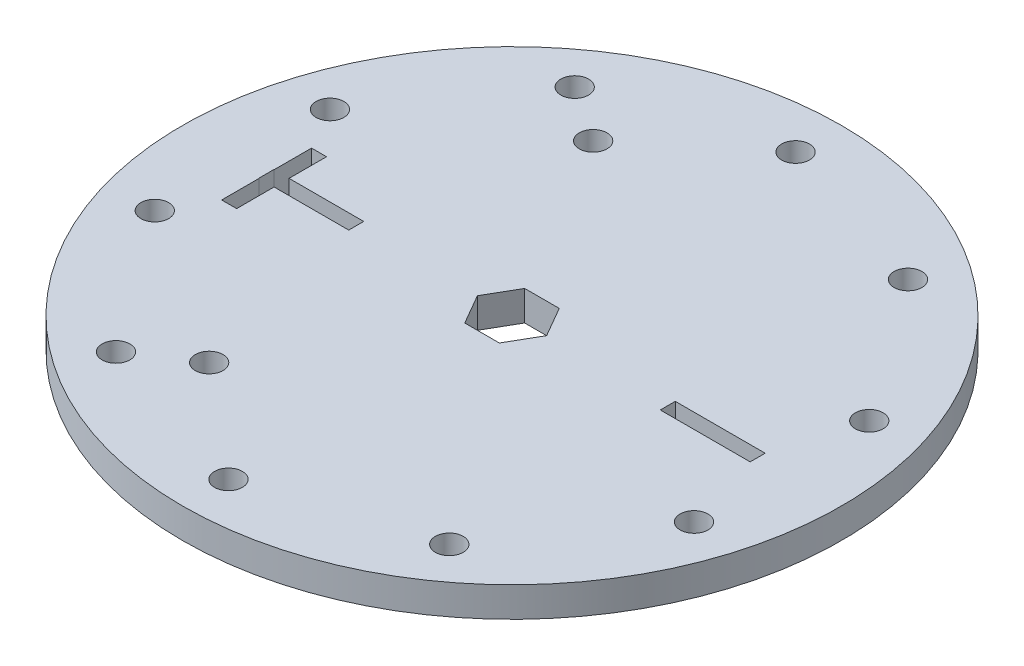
from build123d import *

# Parameters (mm, degrees)
SKETCH1_R             = 34.925
BOSS_EXTRUDE1_DEPTH   = 3.175
F_4_CLEARANCE_HOLE1_D = 2.9464
F_4_CLEARANCE_HOLE4_D = 2.9464
SKETCH5_W             = 9.525
SKETCH5_H             = 1.5875
CUT_EXTRUDE1_DEPTH    = 50.493351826
SKETCH10_W            = 1.5875
SKETCH10_H            = 9.525
CUT_EXTRUDE2_DEPTH    = 50.493351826


with BuildPart() as part:
    # Sketch1 → Boss-Extrude1 (new body)
    with BuildSketch(Plane(origin=(0, 0, 0), x_dir=(1, 0, 0), z_dir=(0, 1, 0))):
        with Locations(Location((0, 0, 0), (0, 0, 270))):
            Circle(SKETCH1_R)
        Polygon((1.833087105, 3.175), (-1.833087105, 3.175), (-3.666174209, 0), (-1.833087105, -3.175), (1.833087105, -3.175), (3.666174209, 0), align=None, mode=Mode.SUBTRACT)
    extrude(amount=BOSS_EXTRUDE1_DEPTH)

    # 4 Clearance Hole1 (through all)
    with Locations(Plane(origin=(0, 3.175, 0), x_dir=(1, 0, 0), z_dir=(0, 1, 0))):
        with Locations((0, 30.045533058), (-17.660321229, 24.307346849), (-28.575, 9.28458032), (-28.575, -9.28458032), (-17.660321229, -24.307346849), (0, -30.045533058), (17.660321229, -24.307346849), (28.575, -9.28458032), (28.575, 9.28458032), (17.660321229, 24.307346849)):
            Hole(F_4_CLEARANCE_HOLE1_D / 2)

    # 4 Clearance Hole4 (through all)
    with Locations(Plane(origin=(0, 3.175, 0), x_dir=(1, 0, 0), z_dir=(0, 1, 0))):
        with Locations((-11.7475, 20.347266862), (-11.7475, -20.347266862)):
            Hole(F_4_CLEARANCE_HOLE4_D / 2)

    # Sketch5 → Cut-Extrude1 (cut, through all)
    with BuildSketch(Plane(origin=(0, 3.175, 0), x_dir=(1, 0, 0), z_dir=(0, 1, 0))):
        with Locations((-21.2725, 0)):
            Rectangle(SKETCH5_W, SKETCH5_H)
        with Locations((21.2725, 0)):
            Rectangle(SKETCH5_W, SKETCH5_H)
    extrude(amount=-CUT_EXTRUDE1_DEPTH, mode=Mode.SUBTRACT)

    # Sketch10 → Cut-Extrude2 (cut, through all)
    with BuildSketch(Plane(origin=(0, 3.175, 0), x_dir=(1, 0, 0), z_dir=(0, 1, 0))):
        with Locations((-25.211848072, 0)):
            Rectangle(SKETCH10_W, SKETCH10_H)
    extrude(amount=-CUT_EXTRUDE2_DEPTH, mode=Mode.SUBTRACT)


solid = part.part
